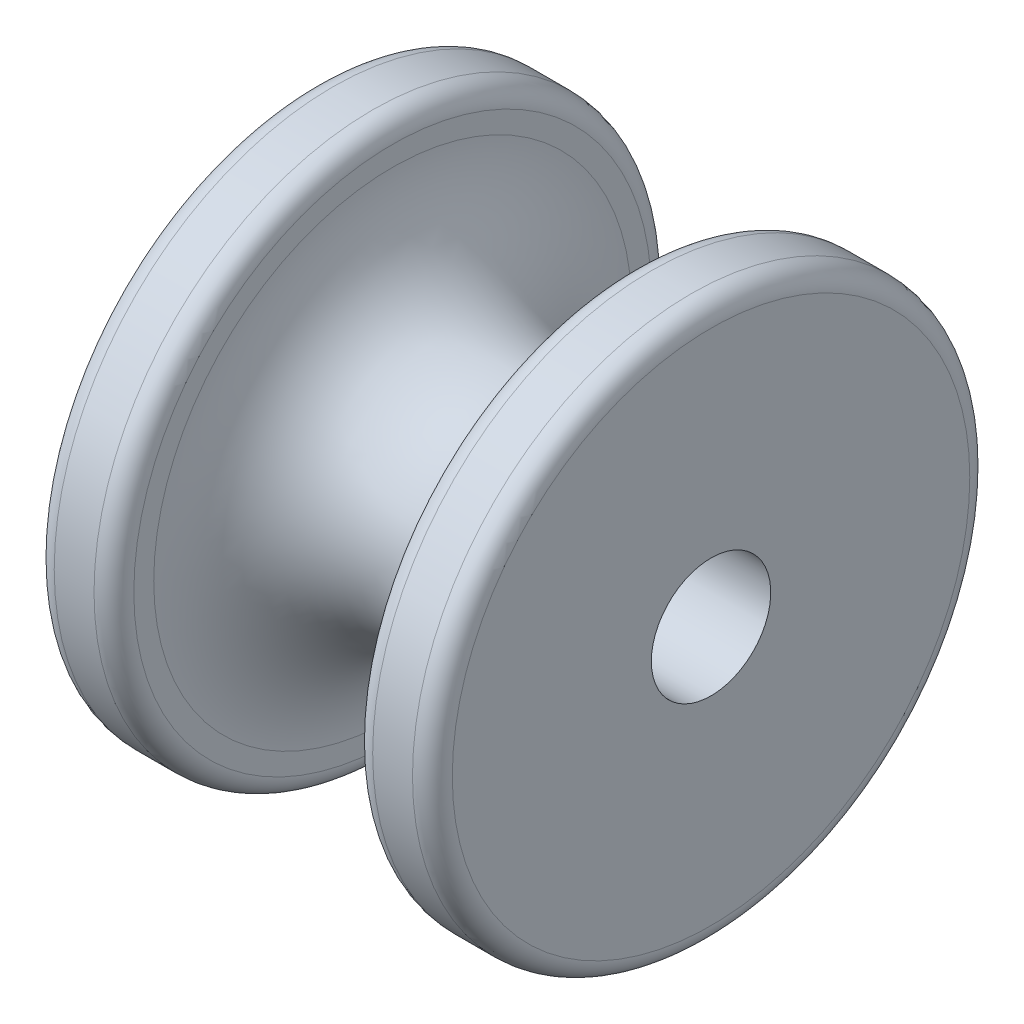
ISO-10303-21;
HEADER;
FILE_DESCRIPTION(('STEP AP214'),'2;1');
FILE_NAME('part.step','',(''),(''),'','','');
FILE_SCHEMA(('AUTOMOTIVE_DESIGN { 1 0 10303 214 1 1 1 1 }'));
ENDSEC;
DATA;
#1=APPLICATION_CONTEXT('core data for automotive mechanical design processes');
#2=APPLICATION_PROTOCOL_DEFINITION('international standard','automotive_design',2000,#1);
#3=PRODUCT_CONTEXT('',#1,'mechanical');
#4=PRODUCT('Part','Part','',(#3));
#5=PRODUCT_RELATED_PRODUCT_CATEGORY('part','',(#4));
#6=PRODUCT_DEFINITION_FORMATION('','',#4);
#7=PRODUCT_DEFINITION_CONTEXT('part definition',#1,'design');
#8=PRODUCT_DEFINITION('design','',#6,#7);
#9=PRODUCT_DEFINITION_SHAPE('','',#8);
#10=(LENGTH_UNIT() NAMED_UNIT(*) SI_UNIT(.MILLI.,.METRE.));
#11=(NAMED_UNIT(*) PLANE_ANGLE_UNIT() SI_UNIT($,.RADIAN.));
#12=(NAMED_UNIT(*) SI_UNIT($,.STERADIAN.) SOLID_ANGLE_UNIT());
#13=UNCERTAINTY_MEASURE_WITH_UNIT(LENGTH_MEASURE(1.E-05),#10,'distance_accuracy_value','');
#14=(GEOMETRIC_REPRESENTATION_CONTEXT(3) GLOBAL_UNCERTAINTY_ASSIGNED_CONTEXT((#13)) GLOBAL_UNIT_ASSIGNED_CONTEXT((#10,
#11,#12)) REPRESENTATION_CONTEXT('',''));
#15=CARTESIAN_POINT('',(0.,0.,0.));
#16=DIRECTION('',(0.,0.,1.));
#17=DIRECTION('',(1.,0.,0.));
#18=AXIS2_PLACEMENT_3D('',#15,#16,#17);
#19=CARTESIAN_POINT('',(5.,0.,0.));
#20=DIRECTION('',(-1.,0.,0.));
#21=DIRECTION('',(0.,0.,1.));
#22=AXIS2_PLACEMENT_3D('',#19,#20,#21);
#23=PLANE('',#22);
#24=CARTESIAN_POINT('',(5.,0.,0.));
#25=DIRECTION('',(-1.,0.,0.));
#26=DIRECTION('',(0.,0.,1.));
#27=AXIS2_PLACEMENT_3D('',#24,#25,#26);
#28=CIRCLE('',#27,1.5);
#29=CARTESIAN_POINT('',(5.,0.,1.5));
#30=VERTEX_POINT('',#29);
#31=EDGE_CURVE('E72',#30,#30,#28,.T.);
#32=ORIENTED_EDGE('',*,*,#31,.T.);
#33=EDGE_LOOP('',(#32));
#34=FACE_BOUND('',#33,.T.);
#35=CARTESIAN_POINT('',(5.,0.,0.));
#36=DIRECTION('',(-1.,0.,0.));
#37=DIRECTION('',(0.,0.,1.));
#38=AXIS2_PLACEMENT_3D('',#35,#36,#37);
#39=CIRCLE('',#38,6.5);
#40=CARTESIAN_POINT('',(5.,0.,6.5));
#41=VERTEX_POINT('',#40);
#42=EDGE_CURVE('E38',#41,#41,#39,.T.);
#43=ORIENTED_EDGE('',*,*,#42,.F.);
#44=EDGE_LOOP('',(#43));
#45=FACE_BOUND('',#44,.T.);
#46=ADVANCED_FACE('F32',(#34,#45),#23,.F.);
#47=CARTESIAN_POINT('',(4.5,0.,0.));
#48=DIRECTION('',(-1.,0.,0.));
#49=DIRECTION('',(0.,0.,1.));
#50=AXIS2_PLACEMENT_3D('',#47,#48,#49);
#51=TOROIDAL_SURFACE('',#50,6.5,0.5);
#52=CARTESIAN_POINT('',(4.5,0.,0.));
#53=DIRECTION('',(-1.,0.,0.));
#54=DIRECTION('',(0.,0.,1.));
#55=AXIS2_PLACEMENT_3D('',#52,#53,#54);
#56=CIRCLE('',#55,7.);
#57=CARTESIAN_POINT('',(4.5,0.,7.));
#58=VERTEX_POINT('',#57);
#59=EDGE_CURVE('E42',#58,#58,#56,.T.);
#60=ORIENTED_EDGE('',*,*,#59,.F.);
#61=EDGE_LOOP('',(#60));
#62=FACE_BOUND('',#61,.T.);
#63=ORIENTED_EDGE('',*,*,#42,.T.);
#64=EDGE_LOOP('',(#63));
#65=FACE_BOUND('',#64,.T.);
#66=ADVANCED_FACE('F97',(#62,#65),#51,.T.);
#67=CARTESIAN_POINT('',(-15.1556723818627,0.,0.));
#68=DIRECTION('',(-1.,0.,0.));
#69=DIRECTION('',(0.,0.,1.));
#70=AXIS2_PLACEMENT_3D('',#67,#68,#69);
#71=CYLINDRICAL_SURFACE('',#70,7.);
#72=CARTESIAN_POINT('',(3.5,0.,0.));
#73=DIRECTION('',(-1.,0.,0.));
#74=DIRECTION('',(0.,0.,1.));
#75=AXIS2_PLACEMENT_3D('',#72,#73,#74);
#76=CIRCLE('',#75,7.);
#77=CARTESIAN_POINT('',(3.5,0.,7.));
#78=VERTEX_POINT('',#77);
#79=EDGE_CURVE('E46',#78,#78,#76,.T.);
#80=ORIENTED_EDGE('',*,*,#79,.F.);
#81=EDGE_LOOP('',(#80));
#82=FACE_BOUND('',#81,.T.);
#83=ORIENTED_EDGE('',*,*,#59,.T.);
#84=EDGE_LOOP('',(#83));
#85=FACE_BOUND('',#84,.T.);
#86=ADVANCED_FACE('F102',(#82,#85),#71,.T.);
#87=CARTESIAN_POINT('',(3.5,0.,0.));
#88=DIRECTION('',(-1.,0.,0.));
#89=DIRECTION('',(0.,0.,1.));
#90=AXIS2_PLACEMENT_3D('',#87,#88,#89);
#91=TOROIDAL_SURFACE('',#90,6.5,0.499999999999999);
#92=CARTESIAN_POINT('',(3.,0.,0.));
#93=DIRECTION('',(-1.,0.,0.));
#94=DIRECTION('',(0.,0.,1.));
#95=AXIS2_PLACEMENT_3D('',#92,#93,#94);
#96=CIRCLE('',#95,6.5);
#97=CARTESIAN_POINT('',(3.,0.,6.5));
#98=VERTEX_POINT('',#97);
#99=EDGE_CURVE('E51',#98,#98,#96,.T.);
#100=ORIENTED_EDGE('',*,*,#99,.F.);
#101=EDGE_LOOP('',(#100));
#102=FACE_BOUND('',#101,.T.);
#103=ORIENTED_EDGE('',*,*,#79,.T.);
#104=EDGE_LOOP('',(#103));
#105=FACE_BOUND('',#104,.T.);
#106=ADVANCED_FACE('F148',(#102,#105),#91,.T.);
#107=CARTESIAN_POINT('',(3.,6.,0.));
#108=DIRECTION('',(1.,0.,0.));
#109=DIRECTION('',(0.,0.,-1.));
#110=AXIS2_PLACEMENT_3D('',#107,#108,#109);
#111=PLANE('',#110);
#112=CARTESIAN_POINT('',(3.,0.,0.));
#113=DIRECTION('',(-1.,0.,0.));
#114=DIRECTION('',(0.,0.,1.));
#115=AXIS2_PLACEMENT_3D('',#112,#113,#114);
#116=CIRCLE('',#115,6.);
#117=CARTESIAN_POINT('',(3.,0.,6.));
#118=VERTEX_POINT('',#117);
#119=EDGE_CURVE('E54',#118,#118,#116,.T.);
#120=ORIENTED_EDGE('',*,*,#119,.F.);
#121=EDGE_LOOP('',(#120));
#122=FACE_BOUND('',#121,.T.);
#123=ORIENTED_EDGE('',*,*,#99,.T.);
#124=EDGE_LOOP('',(#123));
#125=FACE_BOUND('',#124,.T.);
#126=ADVANCED_FACE('F142',(#122,#125),#111,.F.);
#127=CARTESIAN_POINT('',(0.,0.,0.));
#128=DIRECTION('',(-1.,0.,0.));
#129=DIRECTION('',(0.,0.,1.));
#130=AXIS2_PLACEMENT_3D('',#127,#128,#129);
#131=TOROIDAL_SURFACE('',#130,6.,3.);
#132=CARTESIAN_POINT('',(-3.,0.,0.));
#133=DIRECTION('',(-1.,0.,0.));
#134=DIRECTION('',(0.,0.,1.));
#135=AXIS2_PLACEMENT_3D('',#132,#133,#134);
#136=CIRCLE('',#135,6.);
#137=CARTESIAN_POINT('',(-3.,0.,6.));
#138=VERTEX_POINT('',#137);
#139=EDGE_CURVE('E57',#138,#138,#136,.T.);
#140=ORIENTED_EDGE('',*,*,#139,.F.);
#141=EDGE_LOOP('',(#140));
#142=FACE_BOUND('',#141,.T.);
#143=ORIENTED_EDGE('',*,*,#119,.T.);
#144=EDGE_LOOP('',(#143));
#145=FACE_BOUND('',#144,.T.);
#146=ADVANCED_FACE('F136',(#142,#145),#131,.F.);
#147=CARTESIAN_POINT('',(-3.,6.,0.));
#148=DIRECTION('',(-1.,0.,0.));
#149=DIRECTION('',(0.,0.,1.));
#150=AXIS2_PLACEMENT_3D('',#147,#148,#149);
#151=PLANE('',#150);
#152=CARTESIAN_POINT('',(-3.,0.,0.));
#153=DIRECTION('',(-1.,0.,0.));
#154=DIRECTION('',(0.,0.,1.));
#155=AXIS2_PLACEMENT_3D('',#152,#153,#154);
#156=CIRCLE('',#155,6.5);
#157=CARTESIAN_POINT('',(-3.,0.,6.5));
#158=VERTEX_POINT('',#157);
#159=EDGE_CURVE('E60',#158,#158,#156,.T.);
#160=ORIENTED_EDGE('',*,*,#159,.F.);
#161=EDGE_LOOP('',(#160));
#162=FACE_BOUND('',#161,.T.);
#163=ORIENTED_EDGE('',*,*,#139,.T.);
#164=EDGE_LOOP('',(#163));
#165=FACE_BOUND('',#164,.T.);
#166=ADVANCED_FACE('F130',(#162,#165),#151,.F.);
#167=CARTESIAN_POINT('',(-3.5,0.,0.));
#168=DIRECTION('',(-1.,0.,0.));
#169=DIRECTION('',(0.,0.,1.));
#170=AXIS2_PLACEMENT_3D('',#167,#168,#169);
#171=TOROIDAL_SURFACE('',#170,6.5,0.499999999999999);
#172=CARTESIAN_POINT('',(-3.5,0.,0.));
#173=DIRECTION('',(-1.,0.,0.));
#174=DIRECTION('',(0.,0.,1.));
#175=AXIS2_PLACEMENT_3D('',#172,#173,#174);
#176=CIRCLE('',#175,7.);
#177=CARTESIAN_POINT('',(-3.5,0.,7.));
#178=VERTEX_POINT('',#177);
#179=EDGE_CURVE('E63',#178,#178,#176,.T.);
#180=ORIENTED_EDGE('',*,*,#179,.F.);
#181=EDGE_LOOP('',(#180));
#182=FACE_BOUND('',#181,.T.);
#183=ORIENTED_EDGE('',*,*,#159,.T.);
#184=EDGE_LOOP('',(#183));
#185=FACE_BOUND('',#184,.T.);
#186=ADVANCED_FACE('F124',(#182,#185),#171,.T.);
#187=CARTESIAN_POINT('',(-15.1556723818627,0.,0.));
#188=DIRECTION('',(-1.,0.,0.));
#189=DIRECTION('',(0.,0.,1.));
#190=AXIS2_PLACEMENT_3D('',#187,#188,#189);
#191=CYLINDRICAL_SURFACE('',#190,7.);
#192=CARTESIAN_POINT('',(-4.5,0.,0.));
#193=DIRECTION('',(-1.,0.,0.));
#194=DIRECTION('',(0.,0.,1.));
#195=AXIS2_PLACEMENT_3D('',#192,#193,#194);
#196=CIRCLE('',#195,7.);
#197=CARTESIAN_POINT('',(-4.5,0.,7.));
#198=VERTEX_POINT('',#197);
#199=EDGE_CURVE('E66',#198,#198,#196,.T.);
#200=ORIENTED_EDGE('',*,*,#199,.F.);
#201=EDGE_LOOP('',(#200));
#202=FACE_BOUND('',#201,.T.);
#203=ORIENTED_EDGE('',*,*,#179,.T.);
#204=EDGE_LOOP('',(#203));
#205=FACE_BOUND('',#204,.T.);
#206=ADVANCED_FACE('F118',(#202,#205),#191,.T.);
#207=CARTESIAN_POINT('',(-4.5,0.,0.));
#208=DIRECTION('',(-1.,0.,0.));
#209=DIRECTION('',(0.,0.,1.));
#210=AXIS2_PLACEMENT_3D('',#207,#208,#209);
#211=TOROIDAL_SURFACE('',#210,6.5,0.5);
#212=CARTESIAN_POINT('',(-5.,0.,0.));
#213=DIRECTION('',(-1.,0.,0.));
#214=DIRECTION('',(0.,0.,1.));
#215=AXIS2_PLACEMENT_3D('',#212,#213,#214);
#216=CIRCLE('',#215,6.5);
#217=CARTESIAN_POINT('',(-5.,0.,6.5));
#218=VERTEX_POINT('',#217);
#219=EDGE_CURVE('E69',#218,#218,#216,.T.);
#220=ORIENTED_EDGE('',*,*,#219,.F.);
#221=EDGE_LOOP('',(#220));
#222=FACE_BOUND('',#221,.T.);
#223=ORIENTED_EDGE('',*,*,#199,.T.);
#224=EDGE_LOOP('',(#223));
#225=FACE_BOUND('',#224,.T.);
#226=ADVANCED_FACE('F111',(#222,#225),#211,.T.);
#227=CARTESIAN_POINT('',(-5.,0.,0.));
#228=DIRECTION('',(1.,0.,0.));
#229=DIRECTION('',(0.,0.,-1.));
#230=AXIS2_PLACEMENT_3D('',#227,#228,#229);
#231=PLANE('',#230);
#232=CARTESIAN_POINT('',(-5.,5.,0.));
#233=DIRECTION('',(1.,0.,0.));
#234=DIRECTION('',(0.,0.,-1.));
#235=AXIS2_PLACEMENT_3D('',#232,#233,#234);
#236=CIRCLE('',#235,0.5);
#237=CARTESIAN_POINT('',(-5.,5.,-0.5));
#238=VERTEX_POINT('',#237);
#239=EDGE_CURVE('E10',#238,#238,#236,.F.);
#240=ORIENTED_EDGE('',*,*,#239,.F.);
#241=EDGE_LOOP('',(#240));
#242=FACE_BOUND('',#241,.T.);
#243=CARTESIAN_POINT('',(-5.,0.,0.));
#244=DIRECTION('',(-1.,0.,0.));
#245=DIRECTION('',(0.,0.,1.));
#246=AXIS2_PLACEMENT_3D('',#243,#244,#245);
#247=CIRCLE('',#246,1.5);
#248=CARTESIAN_POINT('',(-5.,0.,1.5));
#249=VERTEX_POINT('',#248);
#250=EDGE_CURVE('E73',#249,#249,#247,.T.);
#251=ORIENTED_EDGE('',*,*,#250,.F.);
#252=EDGE_LOOP('',(#251));
#253=FACE_BOUND('',#252,.T.);
#254=ORIENTED_EDGE('',*,*,#219,.T.);
#255=EDGE_LOOP('',(#254));
#256=FACE_BOUND('',#255,.T.);
#257=ADVANCED_FACE('F93',(#242,#253,#256),#231,.F.);
#258=CARTESIAN_POINT('',(5.,0.,0.));
#259=DIRECTION('',(-1.,0.,0.));
#260=DIRECTION('',(0.,0.,1.));
#261=AXIS2_PLACEMENT_3D('',#258,#259,#260);
#262=CYLINDRICAL_SURFACE('',#261,1.5);
#263=ORIENTED_EDGE('',*,*,#31,.F.);
#264=EDGE_LOOP('',(#263));
#265=FACE_BOUND('',#264,.T.);
#266=ORIENTED_EDGE('',*,*,#250,.T.);
#267=EDGE_LOOP('',(#266));
#268=FACE_BOUND('',#267,.T.);
#269=ADVANCED_FACE('F86',(#265,#268),#262,.F.);
#270=CARTESIAN_POINT('',(-5.5,5.,0.));
#271=DIRECTION('',(1.,0.,0.));
#272=DIRECTION('',(0.,0.,-1.));
#273=AXIS2_PLACEMENT_3D('',#270,#271,#272);
#274=CYLINDRICAL_SURFACE('',#273,0.5);
#275=CARTESIAN_POINT('',(-5.5,5.,0.));
#276=DIRECTION('',(-1.,0.,0.));
#277=DIRECTION('',(0.,0.,1.));
#278=AXIS2_PLACEMENT_3D('',#275,#276,#277);
#279=CIRCLE('',#278,0.5);
#280=CARTESIAN_POINT('',(-5.5,5.,0.5));
#281=VERTEX_POINT('',#280);
#282=EDGE_CURVE('E76',#281,#281,#279,.T.);
#283=ORIENTED_EDGE('',*,*,#282,.F.);
#284=EDGE_LOOP('',(#283));
#285=FACE_BOUND('',#284,.T.);
#286=ORIENTED_EDGE('',*,*,#239,.T.);
#287=EDGE_LOOP('',(#286));
#288=FACE_BOUND('',#287,.T.);
#289=ADVANCED_FACE('F84',(#285,#288),#274,.T.);
#290=CARTESIAN_POINT('',(-5.5,5.,0.));
#291=DIRECTION('',(-1.,0.,0.));
#292=DIRECTION('',(0.,0.,1.));
#293=AXIS2_PLACEMENT_3D('',#290,#291,#292);
#294=PLANE('',#293);
#295=ORIENTED_EDGE('',*,*,#282,.T.);
#296=EDGE_LOOP('',(#295));
#297=FACE_BOUND('',#296,.T.);
#298=ADVANCED_FACE('F82',(#297),#294,.T.);
#299=CLOSED_SHELL('',(#46,#66,#86,#106,#126,#146,#166,#186,#206,#226,#257,#269,#289,#298));
#300=MANIFOLD_SOLID_BREP('B2',#299);
#301=ADVANCED_BREP_SHAPE_REPRESENTATION('',(#18,#300),#14);
#302=SHAPE_DEFINITION_REPRESENTATION(#9,#301);
ENDSEC;
END-ISO-10303-21;
